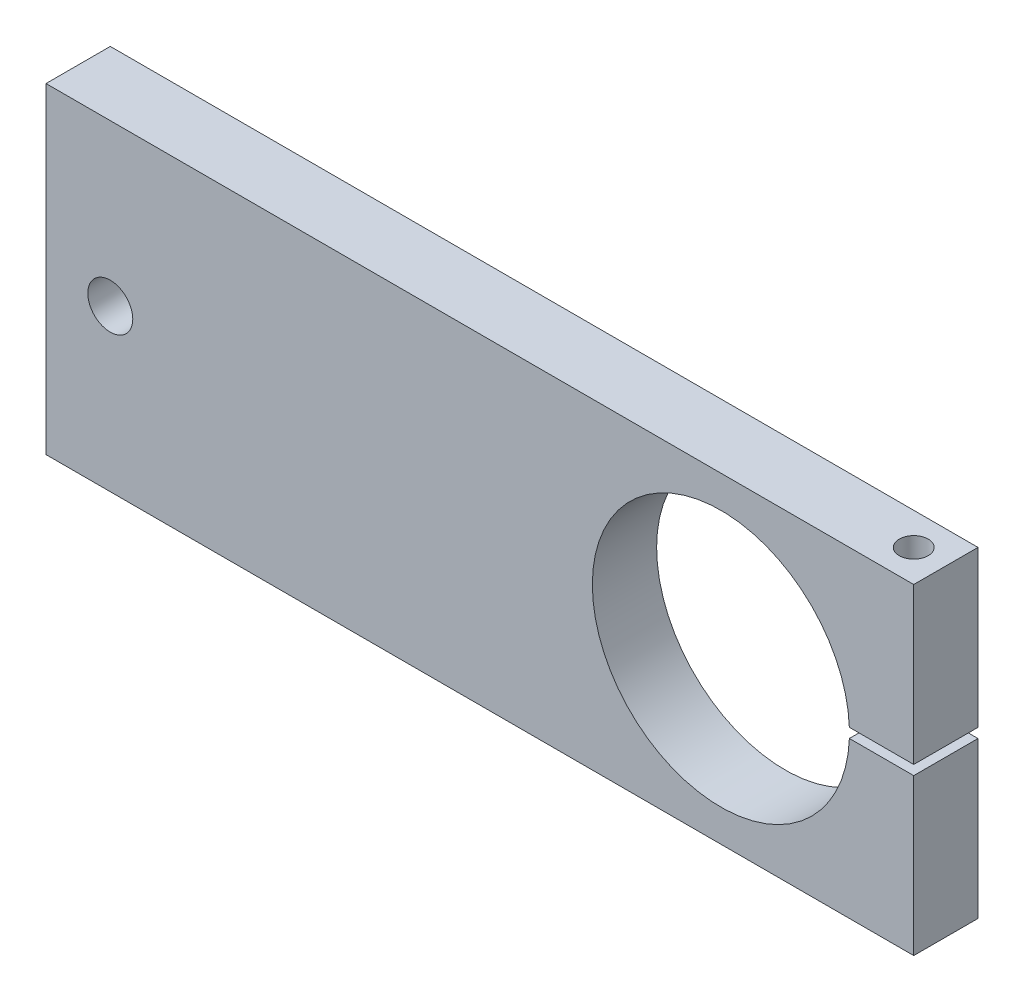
ISO-10303-21;
HEADER;
FILE_DESCRIPTION(('STEP AP214'),'2;1');
FILE_NAME('part.step','',(''),(''),'','','');
FILE_SCHEMA(('AUTOMOTIVE_DESIGN { 1 0 10303 214 1 1 1 1 }'));
ENDSEC;
DATA;
#1=APPLICATION_CONTEXT('core data for automotive mechanical design processes');
#2=APPLICATION_PROTOCOL_DEFINITION('international standard','automotive_design',2000,#1);
#3=PRODUCT_CONTEXT('',#1,'mechanical');
#4=PRODUCT('Part','Part','',(#3));
#5=PRODUCT_RELATED_PRODUCT_CATEGORY('part','',(#4));
#6=PRODUCT_DEFINITION_FORMATION('','',#4);
#7=PRODUCT_DEFINITION_CONTEXT('part definition',#1,'design');
#8=PRODUCT_DEFINITION('design','',#6,#7);
#9=PRODUCT_DEFINITION_SHAPE('','',#8);
#10=(LENGTH_UNIT() NAMED_UNIT(*) SI_UNIT(.MILLI.,.METRE.));
#11=(NAMED_UNIT(*) PLANE_ANGLE_UNIT() SI_UNIT($,.RADIAN.));
#12=(NAMED_UNIT(*) SI_UNIT($,.STERADIAN.) SOLID_ANGLE_UNIT());
#13=UNCERTAINTY_MEASURE_WITH_UNIT(LENGTH_MEASURE(1.E-05),#10,'distance_accuracy_value','');
#14=(GEOMETRIC_REPRESENTATION_CONTEXT(3) GLOBAL_UNCERTAINTY_ASSIGNED_CONTEXT((#13)) GLOBAL_UNIT_ASSIGNED_CONTEXT((#10,
#11,#12)) REPRESENTATION_CONTEXT('',''));
#15=CARTESIAN_POINT('',(0.,0.,0.));
#16=DIRECTION('',(0.,0.,1.));
#17=DIRECTION('',(1.,0.,0.));
#18=AXIS2_PLACEMENT_3D('',#15,#16,#17);
#19=CARTESIAN_POINT('',(0.,0.,20.));
#20=DIRECTION('',(0.,0.,1.));
#21=DIRECTION('',(1.,0.,0.));
#22=AXIS2_PLACEMENT_3D('',#19,#20,#21);
#23=PLANE('',#22);
#24=CARTESIAN_POINT('',(0.,0.,20.));
#25=DIRECTION('',(0.,0.,-1.));
#26=DIRECTION('',(1.,0.,0.));
#27=AXIS2_PLACEMENT_3D('',#24,#25,#26);
#28=CIRCLE('',#27,40.);
#29=CARTESIAN_POINT('',(39.9718651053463,-1.5,20.));
#30=VERTEX_POINT('',#29);
#31=CARTESIAN_POINT('',(39.9718651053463,1.5,20.));
#32=VERTEX_POINT('',#31);
#33=EDGE_CURVE('E149',#30,#32,#28,.T.);
#34=ORIENTED_EDGE('',*,*,#33,.T.);
#35=DIRECTION('',(1.,0.,0.));
#36=VECTOR('',#35,1.);
#37=CARTESIAN_POINT('',(39.9718651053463,1.5,20.));
#38=LINE('',#37,#36);
#39=CARTESIAN_POINT('',(60.,1.50000000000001,20.));
#40=VERTEX_POINT('',#39);
#41=EDGE_CURVE('E97',#32,#40,#38,.T.);
#42=ORIENTED_EDGE('',*,*,#41,.T.);
#43=DIRECTION('',(0.,1.,0.));
#44=VECTOR('',#43,1.);
#45=CARTESIAN_POINT('',(60.,1.50000000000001,20.));
#46=LINE('',#45,#44);
#47=CARTESIAN_POINT('',(60.,50.,20.));
#48=VERTEX_POINT('',#47);
#49=EDGE_CURVE('E164',#40,#48,#46,.T.);
#50=ORIENTED_EDGE('',*,*,#49,.T.);
#51=DIRECTION('',(-1.,0.,0.));
#52=VECTOR('',#51,1.);
#53=CARTESIAN_POINT('',(60.,50.,20.));
#54=LINE('',#53,#52);
#55=CARTESIAN_POINT('',(-210.,50.,20.));
#56=VERTEX_POINT('',#55);
#57=EDGE_CURVE('E177',#48,#56,#54,.T.);
#58=ORIENTED_EDGE('',*,*,#57,.T.);
#59=DIRECTION('',(0.,-1.,0.));
#60=VECTOR('',#59,1.);
#61=CARTESIAN_POINT('',(-210.,50.,20.));
#62=LINE('',#61,#60);
#63=CARTESIAN_POINT('',(-210.,-50.,20.));
#64=VERTEX_POINT('',#63);
#65=EDGE_CURVE('E116',#56,#64,#62,.T.);
#66=ORIENTED_EDGE('',*,*,#65,.T.);
#67=DIRECTION('',(1.,0.,0.));
#68=VECTOR('',#67,1.);
#69=CARTESIAN_POINT('',(-210.,-50.,20.));
#70=LINE('',#69,#68);
#71=CARTESIAN_POINT('',(60.,-50.,20.));
#72=VERTEX_POINT('',#71);
#73=EDGE_CURVE('E110',#64,#72,#70,.T.);
#74=ORIENTED_EDGE('',*,*,#73,.T.);
#75=DIRECTION('',(0.,1.,0.));
#76=VECTOR('',#75,1.);
#77=CARTESIAN_POINT('',(60.,-50.,20.));
#78=LINE('',#77,#76);
#79=CARTESIAN_POINT('',(60.,-1.49999999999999,20.));
#80=VERTEX_POINT('',#79);
#81=EDGE_CURVE('E114',#72,#80,#78,.T.);
#82=ORIENTED_EDGE('',*,*,#81,.T.);
#83=DIRECTION('',(-1.,0.,0.));
#84=VECTOR('',#83,1.);
#85=CARTESIAN_POINT('',(39.9718651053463,-1.5,20.));
#86=LINE('',#85,#84);
#87=EDGE_CURVE('E54',#80,#30,#86,.T.);
#88=ORIENTED_EDGE('',*,*,#87,.T.);
#89=EDGE_LOOP('',(#34,#42,#50,#58,#66,#74,#82,#88));
#90=FACE_BOUND('',#89,.T.);
#91=CARTESIAN_POINT('',(-190.,0.,20.));
#92=DIRECTION('',(0.,0.,1.));
#93=DIRECTION('',(1.,0.,0.));
#94=AXIS2_PLACEMENT_3D('',#91,#92,#93);
#95=CIRCLE('',#94,7.00000000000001);
#96=CARTESIAN_POINT('',(-183.,0.,20.));
#97=VERTEX_POINT('',#96);
#98=EDGE_CURVE('E138',#97,#97,#95,.T.);
#99=ORIENTED_EDGE('',*,*,#98,.F.);
#100=EDGE_LOOP('',(#99));
#101=FACE_BOUND('',#100,.T.);
#102=ADVANCED_FACE('F37',(#90,#101),#23,.T.);
#103=CARTESIAN_POINT('',(0.,0.,0.));
#104=DIRECTION('',(0.,0.,1.));
#105=DIRECTION('',(1.,0.,0.));
#106=AXIS2_PLACEMENT_3D('',#103,#104,#105);
#107=PLANE('',#106);
#108=CARTESIAN_POINT('',(0.,0.,0.));
#109=DIRECTION('',(0.,0.,-1.));
#110=DIRECTION('',(1.,0.,0.));
#111=AXIS2_PLACEMENT_3D('',#108,#109,#110);
#112=CIRCLE('',#111,40.);
#113=CARTESIAN_POINT('',(39.9718651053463,-1.5,0.));
#114=VERTEX_POINT('',#113);
#115=CARTESIAN_POINT('',(39.9718651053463,1.5,0.));
#116=VERTEX_POINT('',#115);
#117=EDGE_CURVE('E134',#114,#116,#112,.T.);
#118=ORIENTED_EDGE('',*,*,#117,.F.);
#119=DIRECTION('',(-1.,0.,0.));
#120=VECTOR('',#119,1.);
#121=CARTESIAN_POINT('',(39.9718651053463,-1.5,0.));
#122=LINE('',#121,#120);
#123=CARTESIAN_POINT('',(60.,-1.49999999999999,0.));
#124=VERTEX_POINT('',#123);
#125=EDGE_CURVE('E89',#124,#114,#122,.T.);
#126=ORIENTED_EDGE('',*,*,#125,.F.);
#127=DIRECTION('',(0.,1.,0.));
#128=VECTOR('',#127,1.);
#129=CARTESIAN_POINT('',(60.,-50.,0.));
#130=LINE('',#129,#128);
#131=CARTESIAN_POINT('',(60.,-50.,0.));
#132=VERTEX_POINT('',#131);
#133=EDGE_CURVE('E83',#132,#124,#130,.T.);
#134=ORIENTED_EDGE('',*,*,#133,.F.);
#135=DIRECTION('',(1.,0.,0.));
#136=VECTOR('',#135,1.);
#137=CARTESIAN_POINT('',(-210.,-50.,0.));
#138=LINE('',#137,#136);
#139=CARTESIAN_POINT('',(-210.,-50.,0.));
#140=VERTEX_POINT('',#139);
#141=EDGE_CURVE('E124',#140,#132,#138,.T.);
#142=ORIENTED_EDGE('',*,*,#141,.F.);
#143=DIRECTION('',(0.,-1.,0.));
#144=VECTOR('',#143,1.);
#145=CARTESIAN_POINT('',(-210.,50.,0.));
#146=LINE('',#145,#144);
#147=CARTESIAN_POINT('',(-210.,50.,0.));
#148=VERTEX_POINT('',#147);
#149=EDGE_CURVE('E144',#148,#140,#146,.T.);
#150=ORIENTED_EDGE('',*,*,#149,.F.);
#151=DIRECTION('',(-1.,0.,0.));
#152=VECTOR('',#151,1.);
#153=CARTESIAN_POINT('',(60.,50.,0.));
#154=LINE('',#153,#152);
#155=CARTESIAN_POINT('',(60.,50.,0.));
#156=VERTEX_POINT('',#155);
#157=EDGE_CURVE('E142',#156,#148,#154,.T.);
#158=ORIENTED_EDGE('',*,*,#157,.F.);
#159=DIRECTION('',(0.,1.,0.));
#160=VECTOR('',#159,1.);
#161=CARTESIAN_POINT('',(60.,1.50000000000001,0.));
#162=LINE('',#161,#160);
#163=CARTESIAN_POINT('',(60.,1.50000000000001,0.));
#164=VERTEX_POINT('',#163);
#165=EDGE_CURVE('E140',#164,#156,#162,.T.);
#166=ORIENTED_EDGE('',*,*,#165,.F.);
#167=DIRECTION('',(1.,0.,0.));
#168=VECTOR('',#167,1.);
#169=CARTESIAN_POINT('',(39.9718651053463,1.5,0.));
#170=LINE('',#169,#168);
#171=EDGE_CURVE('E137',#116,#164,#170,.T.);
#172=ORIENTED_EDGE('',*,*,#171,.F.);
#173=EDGE_LOOP('',(#118,#126,#134,#142,#150,#158,#166,#172));
#174=FACE_BOUND('',#173,.T.);
#175=CARTESIAN_POINT('',(-190.,0.,0.));
#176=DIRECTION('',(0.,0.,1.));
#177=DIRECTION('',(1.,0.,0.));
#178=AXIS2_PLACEMENT_3D('',#175,#176,#177);
#179=CIRCLE('',#178,7.00000000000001);
#180=CARTESIAN_POINT('',(-183.,0.,0.));
#181=VERTEX_POINT('',#180);
#182=EDGE_CURVE('E183',#181,#181,#179,.T.);
#183=ORIENTED_EDGE('',*,*,#182,.T.);
#184=EDGE_LOOP('',(#183));
#185=FACE_BOUND('',#184,.T.);
#186=ADVANCED_FACE('F168',(#174,#185),#107,.F.);
#187=CARTESIAN_POINT('',(0.,0.,20.));
#188=DIRECTION('',(0.,0.,-1.));
#189=DIRECTION('',(-1.,0.,0.));
#190=AXIS2_PLACEMENT_3D('',#187,#188,#189);
#191=CYLINDRICAL_SURFACE('',#190,40.);
#192=ORIENTED_EDGE('',*,*,#117,.T.);
#193=DIRECTION('',(0.,0.,-1.));
#194=VECTOR('',#193,1.);
#195=CARTESIAN_POINT('',(39.9718651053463,1.5,20.));
#196=LINE('',#195,#194);
#197=EDGE_CURVE('E11',#32,#116,#196,.T.);
#198=ORIENTED_EDGE('',*,*,#197,.F.);
#199=ORIENTED_EDGE('',*,*,#33,.F.);
#200=DIRECTION('',(0.,0.,-1.));
#201=VECTOR('',#200,1.);
#202=CARTESIAN_POINT('',(39.9718651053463,-1.5,20.));
#203=LINE('',#202,#201);
#204=EDGE_CURVE('E130',#30,#114,#203,.T.);
#205=ORIENTED_EDGE('',*,*,#204,.T.);
#206=EDGE_LOOP('',(#192,#198,#199,#205));
#207=FACE_BOUND('',#206,.T.);
#208=ADVANCED_FACE('F39',(#207),#191,.F.);
#209=CARTESIAN_POINT('',(39.9718651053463,1.5,20.));
#210=DIRECTION('',(0.,1.,0.));
#211=DIRECTION('',(-1.,0.,0.));
#212=AXIS2_PLACEMENT_3D('',#209,#210,#211);
#213=PLANE('',#212);
#214=CARTESIAN_POINT('',(50.,1.50000000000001,10.));
#215=DIRECTION('',(0.,1.,0.));
#216=DIRECTION('',(-1.,0.,0.));
#217=AXIS2_PLACEMENT_3D('',#214,#215,#216);
#218=CIRCLE('',#217,4.5);
#219=CARTESIAN_POINT('',(45.5,1.50000000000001,10.));
#220=VERTEX_POINT('',#219);
#221=EDGE_CURVE('E192',#220,#220,#218,.T.);
#222=ORIENTED_EDGE('',*,*,#221,.T.);
#223=EDGE_LOOP('',(#222));
#224=FACE_BOUND('',#223,.T.);
#225=ORIENTED_EDGE('',*,*,#171,.T.);
#226=DIRECTION('',(0.,0.,-1.));
#227=VECTOR('',#226,1.);
#228=CARTESIAN_POINT('',(60.,1.50000000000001,20.));
#229=LINE('',#228,#227);
#230=EDGE_CURVE('E46',#40,#164,#229,.T.);
#231=ORIENTED_EDGE('',*,*,#230,.F.);
#232=ORIENTED_EDGE('',*,*,#41,.F.);
#233=ORIENTED_EDGE('',*,*,#197,.T.);
#234=EDGE_LOOP('',(#225,#231,#232,#233));
#235=FACE_BOUND('',#234,.T.);
#236=ADVANCED_FACE('F260',(#224,#235),#213,.F.);
#237=CARTESIAN_POINT('',(60.,1.50000000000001,20.));
#238=DIRECTION('',(-1.,0.,0.));
#239=DIRECTION('',(0.,-1.,0.));
#240=AXIS2_PLACEMENT_3D('',#237,#238,#239);
#241=PLANE('',#240);
#242=ORIENTED_EDGE('',*,*,#165,.T.);
#243=DIRECTION('',(0.,0.,-1.));
#244=VECTOR('',#243,1.);
#245=CARTESIAN_POINT('',(60.,50.,20.));
#246=LINE('',#245,#244);
#247=EDGE_CURVE('E156',#48,#156,#246,.T.);
#248=ORIENTED_EDGE('',*,*,#247,.F.);
#249=ORIENTED_EDGE('',*,*,#49,.F.);
#250=ORIENTED_EDGE('',*,*,#230,.T.);
#251=EDGE_LOOP('',(#242,#248,#249,#250));
#252=FACE_BOUND('',#251,.T.);
#253=ADVANCED_FACE('F162',(#252),#241,.F.);
#254=CARTESIAN_POINT('',(60.,50.,20.));
#255=DIRECTION('',(0.,-1.,0.));
#256=DIRECTION('',(1.,0.,0.));
#257=AXIS2_PLACEMENT_3D('',#254,#255,#256);
#258=PLANE('',#257);
#259=CARTESIAN_POINT('',(50.,50.,10.));
#260=DIRECTION('',(0.,-1.,0.));
#261=DIRECTION('',(1.,0.,0.));
#262=AXIS2_PLACEMENT_3D('',#259,#260,#261);
#263=CIRCLE('',#262,4.5);
#264=CARTESIAN_POINT('',(54.5,50.,10.));
#265=VERTEX_POINT('',#264);
#266=EDGE_CURVE('E200',#265,#265,#263,.F.);
#267=ORIENTED_EDGE('',*,*,#266,.F.);
#268=EDGE_LOOP('',(#267));
#269=FACE_BOUND('',#268,.T.);
#270=ORIENTED_EDGE('',*,*,#157,.T.);
#271=DIRECTION('',(0.,0.,-1.));
#272=VECTOR('',#271,1.);
#273=CARTESIAN_POINT('',(-210.,50.,20.));
#274=LINE('',#273,#272);
#275=EDGE_CURVE('E153',#56,#148,#274,.T.);
#276=ORIENTED_EDGE('',*,*,#275,.F.);
#277=ORIENTED_EDGE('',*,*,#57,.F.);
#278=ORIENTED_EDGE('',*,*,#247,.T.);
#279=EDGE_LOOP('',(#270,#276,#277,#278));
#280=FACE_BOUND('',#279,.T.);
#281=ADVANCED_FACE('F173',(#269,#280),#258,.F.);
#282=CARTESIAN_POINT('',(-210.,50.,20.));
#283=DIRECTION('',(1.,0.,0.));
#284=DIRECTION('',(0.,1.,0.));
#285=AXIS2_PLACEMENT_3D('',#282,#283,#284);
#286=PLANE('',#285);
#287=ORIENTED_EDGE('',*,*,#149,.T.);
#288=DIRECTION('',(0.,0.,-1.));
#289=VECTOR('',#288,1.);
#290=CARTESIAN_POINT('',(-210.,-50.,20.));
#291=LINE('',#290,#289);
#292=EDGE_CURVE('E125',#64,#140,#291,.T.);
#293=ORIENTED_EDGE('',*,*,#292,.F.);
#294=ORIENTED_EDGE('',*,*,#65,.F.);
#295=ORIENTED_EDGE('',*,*,#275,.T.);
#296=EDGE_LOOP('',(#287,#293,#294,#295));
#297=FACE_BOUND('',#296,.T.);
#298=ADVANCED_FACE('F176',(#297),#286,.F.);
#299=CARTESIAN_POINT('',(-210.,-50.,20.));
#300=DIRECTION('',(0.,1.,0.));
#301=DIRECTION('',(0.,0.,1.));
#302=AXIS2_PLACEMENT_3D('',#299,#300,#301);
#303=PLANE('',#302);
#304=CARTESIAN_POINT('',(50.,-50.,10.));
#305=DIRECTION('',(0.,-1.,0.));
#306=DIRECTION('',(0.,0.,-1.));
#307=AXIS2_PLACEMENT_3D('',#304,#305,#306);
#308=CIRCLE('',#307,7.);
#309=CARTESIAN_POINT('',(50.,-50.,3.));
#310=VERTEX_POINT('',#309);
#311=EDGE_CURVE('E189',#310,#310,#308,.T.);
#312=ORIENTED_EDGE('',*,*,#311,.F.);
#313=EDGE_LOOP('',(#312));
#314=FACE_BOUND('',#313,.T.);
#315=ORIENTED_EDGE('',*,*,#141,.T.);
#316=DIRECTION('',(0.,0.,-1.));
#317=VECTOR('',#316,1.);
#318=CARTESIAN_POINT('',(60.,-50.,20.));
#319=LINE('',#318,#317);
#320=EDGE_CURVE('E121',#72,#132,#319,.T.);
#321=ORIENTED_EDGE('',*,*,#320,.F.);
#322=ORIENTED_EDGE('',*,*,#73,.F.);
#323=ORIENTED_EDGE('',*,*,#292,.T.);
#324=EDGE_LOOP('',(#315,#321,#322,#323));
#325=FACE_BOUND('',#324,.T.);
#326=ADVANCED_FACE('F122',(#314,#325),#303,.F.);
#327=CARTESIAN_POINT('',(60.,-50.,20.));
#328=DIRECTION('',(-1.,0.,0.));
#329=DIRECTION('',(0.,0.,1.));
#330=AXIS2_PLACEMENT_3D('',#327,#328,#329);
#331=PLANE('',#330);
#332=ORIENTED_EDGE('',*,*,#133,.T.);
#333=DIRECTION('',(0.,0.,-1.));
#334=VECTOR('',#333,1.);
#335=CARTESIAN_POINT('',(60.,-1.49999999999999,20.));
#336=LINE('',#335,#334);
#337=EDGE_CURVE('E126',#80,#124,#336,.T.);
#338=ORIENTED_EDGE('',*,*,#337,.F.);
#339=ORIENTED_EDGE('',*,*,#81,.F.);
#340=ORIENTED_EDGE('',*,*,#320,.T.);
#341=EDGE_LOOP('',(#332,#338,#339,#340));
#342=FACE_BOUND('',#341,.T.);
#343=ADVANCED_FACE('F128',(#342),#331,.F.);
#344=CARTESIAN_POINT('',(39.9718651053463,-1.5,20.));
#345=DIRECTION('',(0.,-1.,0.));
#346=DIRECTION('',(1.,0.,0.));
#347=AXIS2_PLACEMENT_3D('',#344,#345,#346);
#348=PLANE('',#347);
#349=CARTESIAN_POINT('',(50.,-1.5,10.));
#350=DIRECTION('',(0.,-1.,0.));
#351=DIRECTION('',(1.,0.,0.));
#352=AXIS2_PLACEMENT_3D('',#349,#350,#351);
#353=CIRCLE('',#352,4.5);
#354=CARTESIAN_POINT('',(54.5,-1.5,10.));
#355=VERTEX_POINT('',#354);
#356=EDGE_CURVE('E197',#355,#355,#353,.T.);
#357=ORIENTED_EDGE('',*,*,#356,.T.);
#358=EDGE_LOOP('',(#357));
#359=FACE_BOUND('',#358,.T.);
#360=ORIENTED_EDGE('',*,*,#125,.T.);
#361=ORIENTED_EDGE('',*,*,#204,.F.);
#362=ORIENTED_EDGE('',*,*,#87,.F.);
#363=ORIENTED_EDGE('',*,*,#337,.T.);
#364=EDGE_LOOP('',(#360,#361,#362,#363));
#365=FACE_BOUND('',#364,.T.);
#366=ADVANCED_FACE('F229',(#359,#365),#348,.F.);
#367=CARTESIAN_POINT('',(-190.,0.,20.));
#368=DIRECTION('',(0.,0.,-1.));
#369=DIRECTION('',(-1.,0.,0.));
#370=AXIS2_PLACEMENT_3D('',#367,#368,#369);
#371=CYLINDRICAL_SURFACE('',#370,7.00000000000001);
#372=ORIENTED_EDGE('',*,*,#98,.T.);
#373=EDGE_LOOP('',(#372));
#374=FACE_BOUND('',#373,.T.);
#375=ORIENTED_EDGE('',*,*,#182,.F.);
#376=EDGE_LOOP('',(#375));
#377=FACE_BOUND('',#376,.T.);
#378=ADVANCED_FACE('F219',(#374,#377),#371,.F.);
#379=CARTESIAN_POINT('',(50.,-40.,10.));
#380=DIRECTION('',(0.,-1.,0.));
#381=DIRECTION('',(0.,0.,-1.));
#382=AXIS2_PLACEMENT_3D('',#379,#380,#381);
#383=CYLINDRICAL_SURFACE('',#382,7.);
#384=CARTESIAN_POINT('',(50.,-40.,10.));
#385=DIRECTION('',(0.,-1.,0.));
#386=DIRECTION('',(0.,0.,-1.));
#387=AXIS2_PLACEMENT_3D('',#384,#385,#386);
#388=CIRCLE('',#387,7.);
#389=CARTESIAN_POINT('',(50.,-40.,3.));
#390=VERTEX_POINT('',#389);
#391=EDGE_CURVE('E186',#390,#390,#388,.T.);
#392=ORIENTED_EDGE('',*,*,#391,.F.);
#393=EDGE_LOOP('',(#392));
#394=FACE_BOUND('',#393,.T.);
#395=ORIENTED_EDGE('',*,*,#311,.T.);
#396=EDGE_LOOP('',(#395));
#397=FACE_BOUND('',#396,.T.);
#398=ADVANCED_FACE('F213',(#394,#397),#383,.F.);
#399=CARTESIAN_POINT('',(50.,-40.,10.));
#400=DIRECTION('',(0.,-1.,0.));
#401=DIRECTION('',(0.,0.,-1.));
#402=AXIS2_PLACEMENT_3D('',#399,#400,#401);
#403=PLANE('',#402);
#404=CARTESIAN_POINT('',(50.,-40.,10.));
#405=DIRECTION('',(0.,-1.,0.));
#406=DIRECTION('',(0.,0.,-1.));
#407=AXIS2_PLACEMENT_3D('',#404,#405,#406);
#408=CIRCLE('',#407,4.5);
#409=CARTESIAN_POINT('',(50.,-40.,5.5));
#410=VERTEX_POINT('',#409);
#411=EDGE_CURVE('E203',#410,#410,#408,.T.);
#412=ORIENTED_EDGE('',*,*,#411,.F.);
#413=EDGE_LOOP('',(#412));
#414=FACE_BOUND('',#413,.T.);
#415=ORIENTED_EDGE('',*,*,#391,.T.);
#416=EDGE_LOOP('',(#415));
#417=FACE_BOUND('',#416,.T.);
#418=ADVANCED_FACE('F210',(#414,#417),#403,.T.);
#419=CARTESIAN_POINT('',(50.,62.7279220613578,10.));
#420=DIRECTION('',(0.,-1.,0.));
#421=DIRECTION('',(0.,0.,-1.));
#422=AXIS2_PLACEMENT_3D('',#419,#420,#421);
#423=CYLINDRICAL_SURFACE('',#422,4.5);
#424=ORIENTED_EDGE('',*,*,#411,.T.);
#425=EDGE_LOOP('',(#424));
#426=FACE_BOUND('',#425,.T.);
#427=ORIENTED_EDGE('',*,*,#356,.F.);
#428=EDGE_LOOP('',(#427));
#429=FACE_BOUND('',#428,.T.);
#430=ADVANCED_FACE('F207',(#426,#429),#423,.F.);
#431=ORIENTED_EDGE('',*,*,#266,.T.);
#432=EDGE_LOOP('',(#431));
#433=FACE_BOUND('',#432,.T.);
#434=ORIENTED_EDGE('',*,*,#221,.F.);
#435=EDGE_LOOP('',(#434));
#436=FACE_BOUND('',#435,.T.);
#437=ADVANCED_FACE('F248',(#433,#436),#423,.F.);
#438=CLOSED_SHELL('',(#102,#186,#208,#236,#253,#281,#298,#326,#343,#366,#378,#398,#418,#430,#437));
#439=MANIFOLD_SOLID_BREP('B2',#438);
#440=ADVANCED_BREP_SHAPE_REPRESENTATION('',(#18,#439),#14);
#441=SHAPE_DEFINITION_REPRESENTATION(#9,#440);
ENDSEC;
END-ISO-10303-21;
